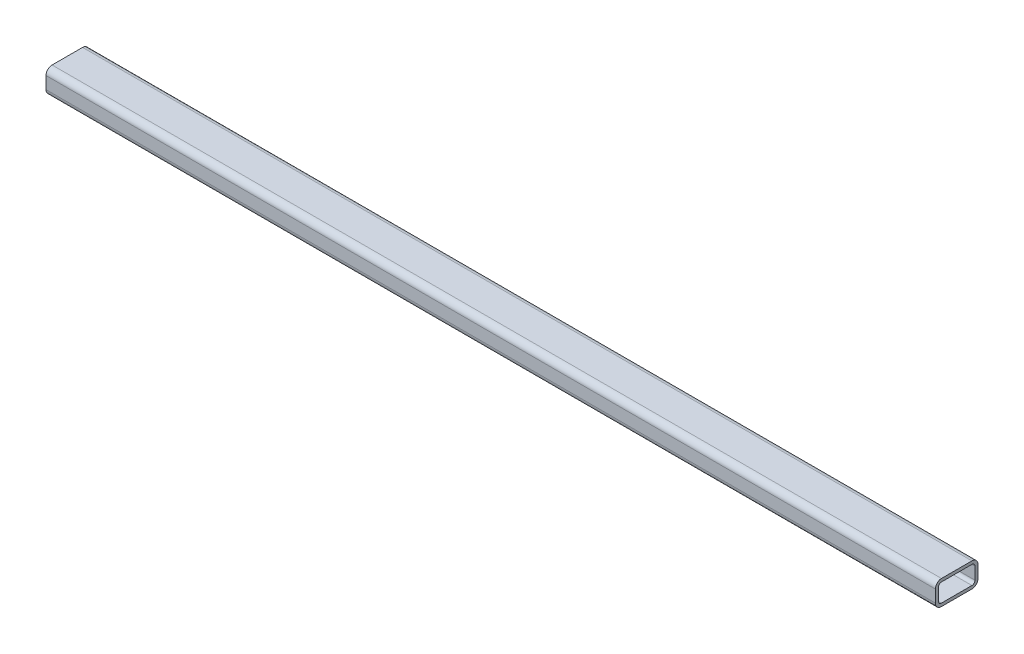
from build123d import *

# Parameters (mm, degrees)
BASE_EXTRUSION_DEPTH = 730


with BuildPart() as part:
    # Esquisse1 → Base-Extrusion (new body)
    with BuildSketch(Plane(origin=(0, 0, 0), x_dir=(0, 0, -1), z_dir=(1, 0, 0))):
        with BuildLine():
            Line((-12.5, 10), (12.5, 10))
            ThreePointArc((12.5, 10), (16.035533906, 8.535533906), (17.5, 5))
            Line((17.5, 5), (17.5, -5))
            ThreePointArc((17.5, -5), (16.035533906, -8.535533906), (12.5, -10))
            Line((12.5, -10), (-12.5, -10))
            ThreePointArc((-12.5, -10), (-16.035533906, -8.535533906), (-17.5, -5))
            Line((-17.5, -5), (-17.5, 5))
            ThreePointArc((-17.5, 5), (-16.035533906, 8.535533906), (-12.5, 10))
        make_face()
        with BuildLine():
            Line((-12.5, 7.5), (12.5, 7.5))
            ThreePointArc((12.5, 7.5), (14.267766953, 6.767766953), (15, 5))
            Line((15, 5), (15, -5))
            ThreePointArc((15, -5), (14.267766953, -6.767766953), (12.5, -7.5))
            Line((12.5, -7.5), (-12.5, -7.5))
            ThreePointArc((-12.5, -7.5), (-14.267766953, -6.767766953), (-15, -5))
            Line((-15, -5), (-15, 5))
            ThreePointArc((-15, 5), (-14.267766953, 6.767766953), (-12.5, 7.5))
        make_face(mode=Mode.SUBTRACT)
    extrude(amount=BASE_EXTRUSION_DEPTH)


solid = part.part
